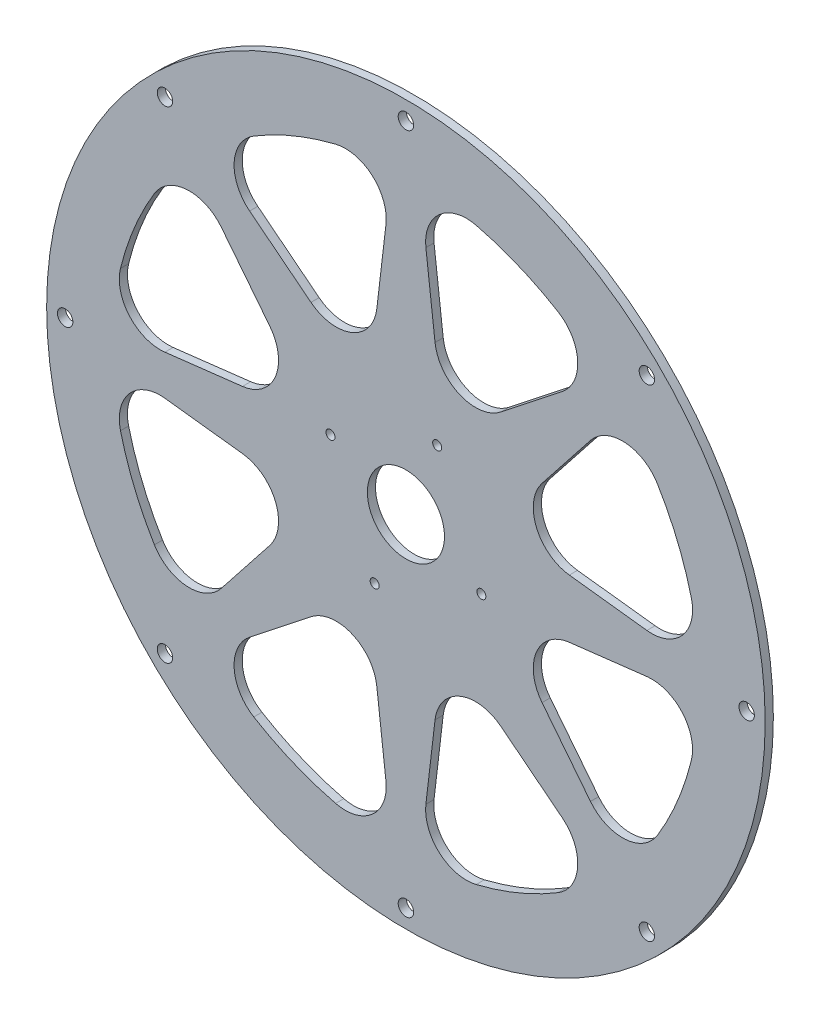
from build123d import *

# Parameters (mm, degrees)
SKETCH1_R                = 279.4
SKETCH1_R_2              = 6
SKETCH1_R_3              = 30
BOSS_EXTRUDE1_DEPTH      = 6.35
SKETCH2_R                = 3.5
CUT_EXTRUDE1_DEPTH       = 825.233491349
CUT_EXTRUDE2_DEPTH       = 825.233491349
FILLET1_R                = 31.75
CIRPATTERN2_COUNT        = 8
FILLET1_OF_CIRPATTERN2_R = 31.75


with BuildPart() as part:
    # Sketch1 → Boss-Extrude1 (new body)
    with BuildSketch(Plane.XY):
        with Locations((300, 306.787824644)):
            Circle(SKETCH1_R)
        with Locations((300, 571.787824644)):
            Circle(SKETCH1_R_2, mode=Mode.SUBTRACT)
        with Locations((112.616702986, 494.171121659)):
            Circle(SKETCH1_R_2, mode=Mode.SUBTRACT)
        with Locations((35, 306.787824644)):
            Circle(SKETCH1_R_2, mode=Mode.SUBTRACT)
        with Locations((112.616702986, 119.40452763)):
            Circle(SKETCH1_R_2, mode=Mode.SUBTRACT)
        with Locations((300, 41.787824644)):
            Circle(SKETCH1_R_2, mode=Mode.SUBTRACT)
        with Locations((487.383297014, 119.40452763)):
            Circle(SKETCH1_R_2, mode=Mode.SUBTRACT)
        with Locations((565, 306.787824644)):
            Circle(SKETCH1_R_2, mode=Mode.SUBTRACT)
        with Locations((487.383297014, 494.171121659)):
            Circle(SKETCH1_R_2, mode=Mode.SUBTRACT)
        with Locations((300, 306.787824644)):
            Circle(SKETCH1_R_3, mode=Mode.SUBTRACT)
    extrude(amount=BOSS_EXTRUDE1_DEPTH)

    # Sketch2 → Cut-Extrude1 (cut, through all)
    with BuildSketch(Plane.XY.offset(6.35)):
        with Locations((358.666350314, 282.487426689)):
            Circle(SKETCH2_R)
        with Locations((275.699602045, 248.12147433)):
            Circle(SKETCH2_R)
        with Locations((241.333649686, 331.088222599)):
            Circle(SKETCH2_R)
        with Locations((324.300397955, 365.454174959)):
            Circle(SKETCH2_R)
    extrude(amount=-CUT_EXTRUDE1_DEPTH, mode=Mode.SUBTRACT)

    # Sketch3 → Cut-Extrude2 (cut, through all)
    with BuildSketch(Plane.XY.offset(6.35)):
        with BuildLine():
            ThreePointArc((146.106273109, 137.74735368), (212.518567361, 95.588963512), (289.289634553, 78.438863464))
            Line((289.289634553, 78.438863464), (270.72120973, 236.102572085))
            Line((270.72120973, 236.102572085), (146.106273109, 137.74735368))
        make_face()
    cut_extrude2 = extrude(amount=-CUT_EXTRUDE2_DEPTH, mode=Mode.SUBTRACT)

    # Fillet1
    fillet1_edges = [part.edges().sort_by_distance(p)[0] for p in [
        (146.106273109, 137.74735368, 3.175),
        (270.72120973, 236.102572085, 3.175),
        (289.289634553, 78.438863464, 3.175),
    ]]
    fillet(fillet1_edges, radius=FILLET1_R)

    # CirPattern2: Cut-Extrude2 ×8 about axis
    cirpattern2_axis = Axis((300, 306.787824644, 0), (0, 0, 1))
    for i in range(1, CIRPATTERN2_COUNT):
        add(cut_extrude2.rotate(cirpattern2_axis, i * 360 / CIRPATTERN2_COUNT), mode=Mode.SUBTRACT)

    # Fillet1 of CirPattern2
    fillet1_of_cirpattern2_edges = [part.edges().sort_by_distance(p)[0] for p in [
        (310.710365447, 78.438863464, 3.175),
        (329.27879027, 236.102572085, 3.175),
        (453.893726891, 137.74735368, 3.175),
        (469.040470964, 152.894097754, 3.175),
        (370.68525256, 277.509034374, 3.175),
        (528.34896118, 296.077459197, 3.175),
        (528.34896118, 317.498190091, 3.175),
        (370.68525256, 336.066614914, 3.175),
        (469.040470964, 460.681551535, 3.175),
        (453.893726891, 475.828295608, 3.175),
        (329.27879027, 377.473077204, 3.175),
        (310.710365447, 535.136785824, 3.175),
        (289.289634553, 535.136785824, 3.175),
        (270.72120973, 377.473077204, 3.175),
        (146.106273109, 475.828295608, 3.175),
        (130.959529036, 460.681551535, 3.175),
        (229.31474744, 336.066614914, 3.175),
        (71.65103882, 317.498190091, 3.175),
        (71.65103882, 296.077459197, 3.175),
        (229.31474744, 277.509034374, 3.175),
        (130.959529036, 152.894097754, 3.175),
    ]]
    fillet(fillet1_of_cirpattern2_edges, radius=FILLET1_OF_CIRPATTERN2_R)


solid = part.part
